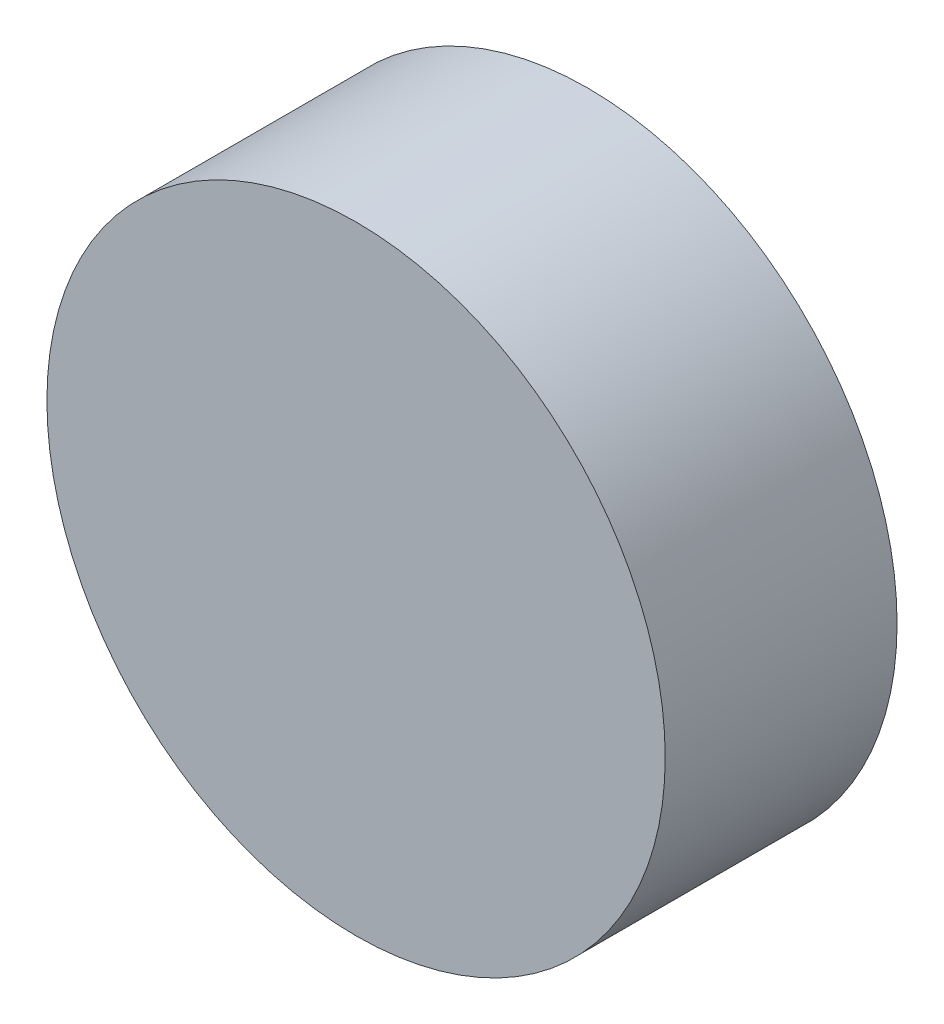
from build123d import *

# Parameters (mm, degrees)
FOOT_ENVELOPE_START = -6
SKETCH_1_R          = 8
FOOT_ENVELOPE_DEPTH = 6


with BuildPart() as part:
    # Sketch 1 → Foot_envelope (new body)
    with BuildSketch(Plane.XY.offset(FOOT_ENVELOPE_START)):
        Circle(SKETCH_1_R)
    extrude(amount=FOOT_ENVELOPE_DEPTH)


solid = part.part
